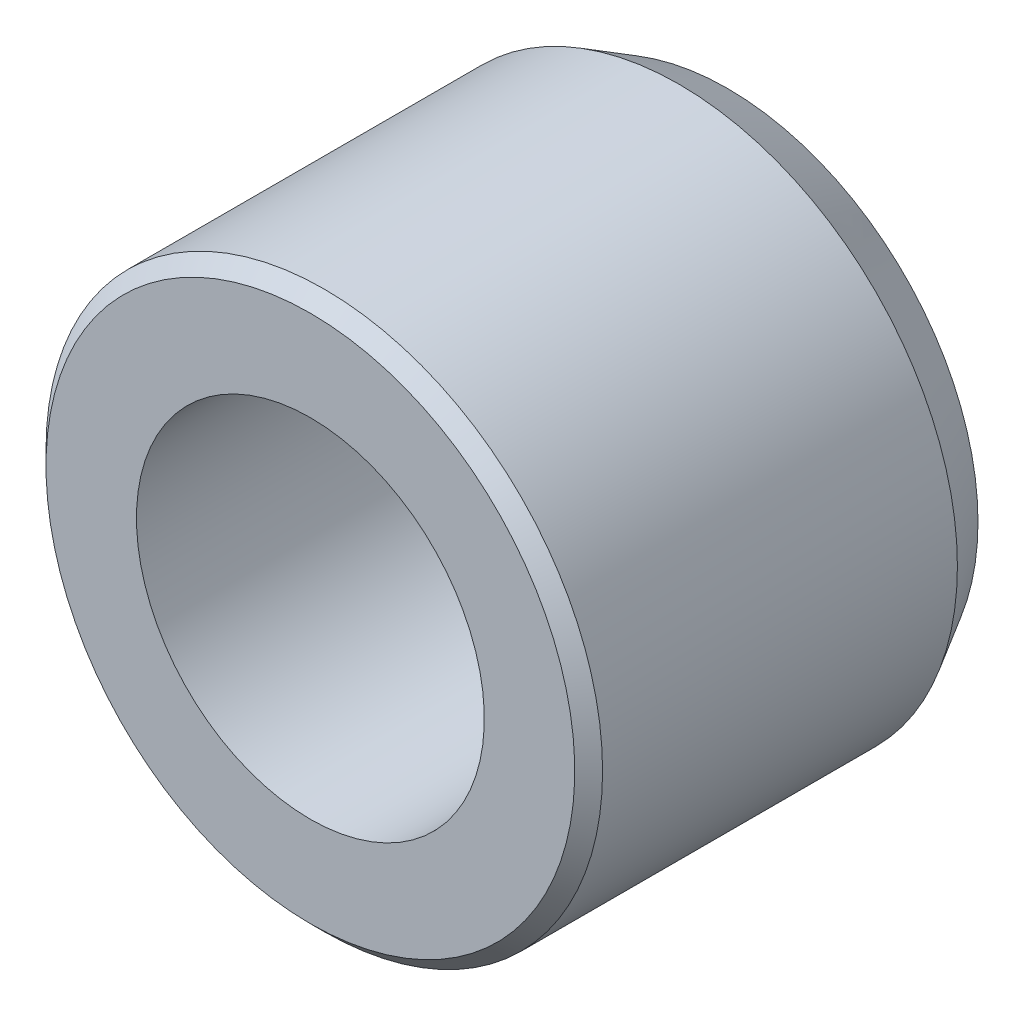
ISO-10303-21;
HEADER;
FILE_DESCRIPTION(('STEP AP214'),'2;1');
FILE_NAME('part.step','',(''),(''),'','','');
FILE_SCHEMA(('AUTOMOTIVE_DESIGN { 1 0 10303 214 1 1 1 1 }'));
ENDSEC;
DATA;
#1=APPLICATION_CONTEXT('core data for automotive mechanical design processes');
#2=APPLICATION_PROTOCOL_DEFINITION('international standard','automotive_design',2000,#1);
#3=PRODUCT_CONTEXT('',#1,'mechanical');
#4=PRODUCT('Part','Part','',(#3));
#5=PRODUCT_RELATED_PRODUCT_CATEGORY('part','',(#4));
#6=PRODUCT_DEFINITION_FORMATION('','',#4);
#7=PRODUCT_DEFINITION_CONTEXT('part definition',#1,'design');
#8=PRODUCT_DEFINITION('design','',#6,#7);
#9=PRODUCT_DEFINITION_SHAPE('','',#8);
#10=(LENGTH_UNIT() NAMED_UNIT(*) SI_UNIT(.MILLI.,.METRE.));
#11=(NAMED_UNIT(*) PLANE_ANGLE_UNIT() SI_UNIT($,.RADIAN.));
#12=(NAMED_UNIT(*) SI_UNIT($,.STERADIAN.) SOLID_ANGLE_UNIT());
#13=UNCERTAINTY_MEASURE_WITH_UNIT(LENGTH_MEASURE(1.E-05),#10,'distance_accuracy_value','');
#14=(GEOMETRIC_REPRESENTATION_CONTEXT(3) GLOBAL_UNCERTAINTY_ASSIGNED_CONTEXT((#13)) GLOBAL_UNIT_ASSIGNED_CONTEXT((#10,
#11,#12)) REPRESENTATION_CONTEXT('',''));
#15=CARTESIAN_POINT('',(0.,0.,0.));
#16=DIRECTION('',(0.,0.,1.));
#17=DIRECTION('',(1.,0.,0.));
#18=AXIS2_PLACEMENT_3D('',#15,#16,#17);
#19=CARTESIAN_POINT('',(0.,0.,-6.));
#20=DIRECTION('',(0.,0.,1.));
#21=DIRECTION('',(0.,-1.,0.));
#22=AXIS2_PLACEMENT_3D('',#19,#20,#21);
#23=CYLINDRICAL_SURFACE('',#22,2.5);
#24=CARTESIAN_POINT('',(0.,0.,0.));
#25=DIRECTION('',(0.,0.,1.));
#26=DIRECTION('',(0.,-1.,0.));
#27=AXIS2_PLACEMENT_3D('',#24,#25,#26);
#28=CIRCLE('',#27,2.5);
#29=CARTESIAN_POINT('',(0.,-2.5,0.));
#30=VERTEX_POINT('',#29);
#31=EDGE_CURVE('E15',#30,#30,#28,.F.);
#32=ORIENTED_EDGE('',*,*,#31,.F.);
#33=EDGE_LOOP('',(#32));
#34=FACE_BOUND('',#33,.T.);
#35=CARTESIAN_POINT('',(0.,0.,-6.));
#36=DIRECTION('',(0.,0.,1.));
#37=DIRECTION('',(0.,-1.,0.));
#38=AXIS2_PLACEMENT_3D('',#35,#36,#37);
#39=CIRCLE('',#38,2.5);
#40=CARTESIAN_POINT('',(0.,-2.5,-6.));
#41=VERTEX_POINT('',#40);
#42=EDGE_CURVE('E35',#41,#41,#39,.T.);
#43=ORIENTED_EDGE('',*,*,#42,.F.);
#44=EDGE_LOOP('',(#43));
#45=FACE_BOUND('',#44,.T.);
#46=ADVANCED_FACE('F12',(#34,#45),#23,.F.);
#47=CARTESIAN_POINT('',(3.8,0.,0.));
#48=DIRECTION('',(0.,0.,1.));
#49=DIRECTION('',(0.,-1.,0.));
#50=AXIS2_PLACEMENT_3D('',#47,#48,#49);
#51=PLANE('',#50);
#52=CARTESIAN_POINT('',(0.,0.,2.86489582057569E-11));
#53=DIRECTION('',(0.,0.,-1.));
#54=DIRECTION('',(0.,1.,0.));
#55=AXIS2_PLACEMENT_3D('',#52,#53,#54);
#56=CIRCLE('',#55,3.80000000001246);
#57=CARTESIAN_POINT('',(0.,3.80000000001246,2.86489582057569E-11));
#58=VERTEX_POINT('',#57);
#59=EDGE_CURVE('E33',#58,#58,#56,.T.);
#60=ORIENTED_EDGE('',*,*,#59,.F.);
#61=EDGE_LOOP('',(#60));
#62=FACE_BOUND('',#61,.T.);
#63=ORIENTED_EDGE('',*,*,#31,.T.);
#64=EDGE_LOOP('',(#63));
#65=FACE_BOUND('',#64,.T.);
#66=ADVANCED_FACE('F42',(#62,#65),#51,.T.);
#67=CARTESIAN_POINT('',(2.5,0.,-6.));
#68=DIRECTION('',(0.,0.,-1.));
#69=DIRECTION('',(0.,1.,0.));
#70=AXIS2_PLACEMENT_3D('',#67,#68,#69);
#71=PLANE('',#70);
#72=ORIENTED_EDGE('',*,*,#42,.T.);
#73=EDGE_LOOP('',(#72));
#74=FACE_BOUND('',#73,.T.);
#75=CARTESIAN_POINT('',(0.,0.,-6.));
#76=DIRECTION('',(0.,0.,1.));
#77=DIRECTION('',(0.,-1.,0.));
#78=AXIS2_PLACEMENT_3D('',#75,#76,#77);
#79=CIRCLE('',#78,3.59585481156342);
#80=CARTESIAN_POINT('',(0.,-3.59585481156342,-6.));
#81=VERTEX_POINT('',#80);
#82=EDGE_CURVE('E24',#81,#81,#79,.T.);
#83=ORIENTED_EDGE('',*,*,#82,.F.);
#84=EDGE_LOOP('',(#83));
#85=FACE_BOUND('',#84,.T.);
#86=ADVANCED_FACE('F50',(#74,#85),#71,.T.);
#87=CARTESIAN_POINT('',(0.,0.,-0.199999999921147));
#88=DIRECTION('',(0.,0.,-1.));
#89=DIRECTION('',(0.,1.,0.));
#90=AXIS2_PLACEMENT_3D('',#87,#88,#89);
#91=CONICAL_SURFACE('',#90,4.0000000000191,0.785398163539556);
#92=CARTESIAN_POINT('',(0.,0.,-0.2));
#93=DIRECTION('',(0.,0.,1.));
#94=DIRECTION('',(0.,-1.,0.));
#95=AXIS2_PLACEMENT_3D('',#92,#93,#94);
#96=CIRCLE('',#95,4.);
#97=CARTESIAN_POINT('',(0.,-4.,-0.2));
#98=VERTEX_POINT('',#97);
#99=EDGE_CURVE('E19',#98,#98,#96,.F.);
#100=ORIENTED_EDGE('',*,*,#99,.F.);
#101=EDGE_LOOP('',(#100));
#102=FACE_BOUND('',#101,.T.);
#103=ORIENTED_EDGE('',*,*,#59,.T.);
#104=EDGE_LOOP('',(#103));
#105=FACE_BOUND('',#104,.T.);
#106=ADVANCED_FACE('F59',(#102,#105),#91,.T.);
#107=CARTESIAN_POINT('',(0.,0.,-5.30000000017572));
#108=DIRECTION('',(0.,0.,1.));
#109=DIRECTION('',(0.,-1.,0.));
#110=AXIS2_PLACEMENT_3D('',#107,#108,#109);
#111=CONICAL_SURFACE('',#110,3.99999999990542,0.523598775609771);
#112=ORIENTED_EDGE('',*,*,#82,.T.);
#113=EDGE_LOOP('',(#112));
#114=FACE_BOUND('',#113,.T.);
#115=CARTESIAN_POINT('',(0.,0.,-5.3));
#116=DIRECTION('',(0.,0.,1.));
#117=DIRECTION('',(0.,-1.,0.));
#118=AXIS2_PLACEMENT_3D('',#115,#116,#117);
#119=CIRCLE('',#118,4.);
#120=CARTESIAN_POINT('',(0.,-4.,-5.3));
#121=VERTEX_POINT('',#120);
#122=EDGE_CURVE('E8',#121,#121,#119,.T.);
#123=ORIENTED_EDGE('',*,*,#122,.F.);
#124=EDGE_LOOP('',(#123));
#125=FACE_BOUND('',#124,.T.);
#126=ADVANCED_FACE('F54',(#114,#125),#111,.T.);
#127=CARTESIAN_POINT('',(0.,0.,-6.));
#128=DIRECTION('',(0.,0.,1.));
#129=DIRECTION('',(0.,-1.,0.));
#130=AXIS2_PLACEMENT_3D('',#127,#128,#129);
#131=CYLINDRICAL_SURFACE('',#130,4.);
#132=ORIENTED_EDGE('',*,*,#122,.T.);
#133=EDGE_LOOP('',(#132));
#134=FACE_BOUND('',#133,.T.);
#135=ORIENTED_EDGE('',*,*,#99,.T.);
#136=EDGE_LOOP('',(#135));
#137=FACE_BOUND('',#136,.T.);
#138=ADVANCED_FACE('F52',(#134,#137),#131,.T.);
#139=CLOSED_SHELL('',(#46,#66,#86,#106,#126,#138));
#140=MANIFOLD_SOLID_BREP('B1',#139);
#141=ADVANCED_BREP_SHAPE_REPRESENTATION('',(#18,#140),#14);
#142=SHAPE_DEFINITION_REPRESENTATION(#9,#141);
ENDSEC;
END-ISO-10303-21;
